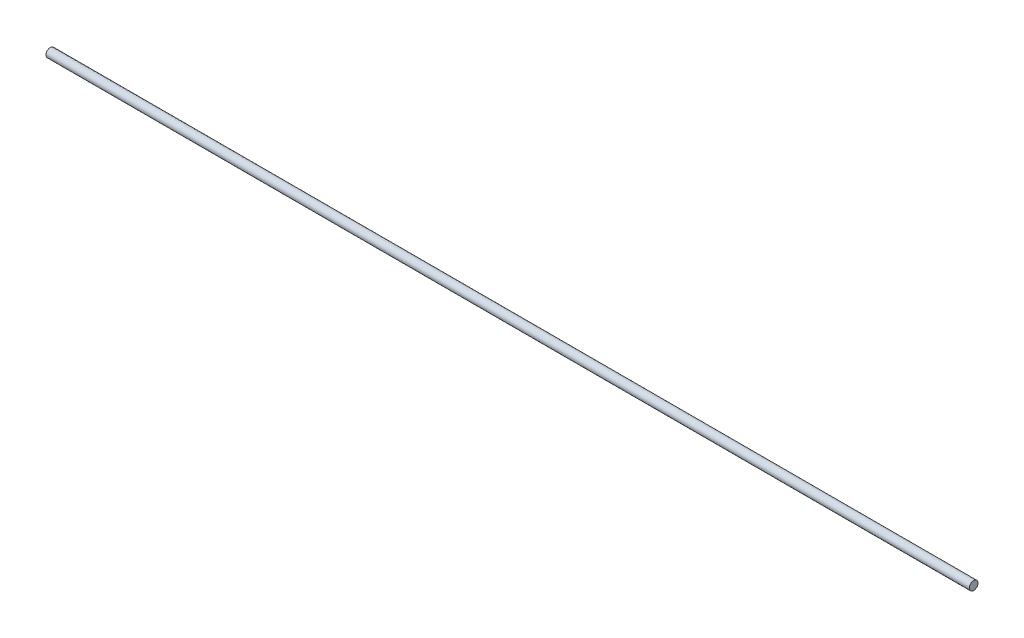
from build123d import *

# Parameters (mm, degrees)
ESQUISSE2_R      = 0.425
EXTRUSION1_DEPTH = 90


with BuildPart() as part:
    # Esquisse2 → Extrusion1 (new body)
    with BuildSketch(Plane(origin=(0, 0, 0), x_dir=(0, 0, -1), z_dir=(1, 0, 0))):
        Circle(ESQUISSE2_R)
    extrude(amount=EXTRUSION1_DEPTH)


solid = part.part
